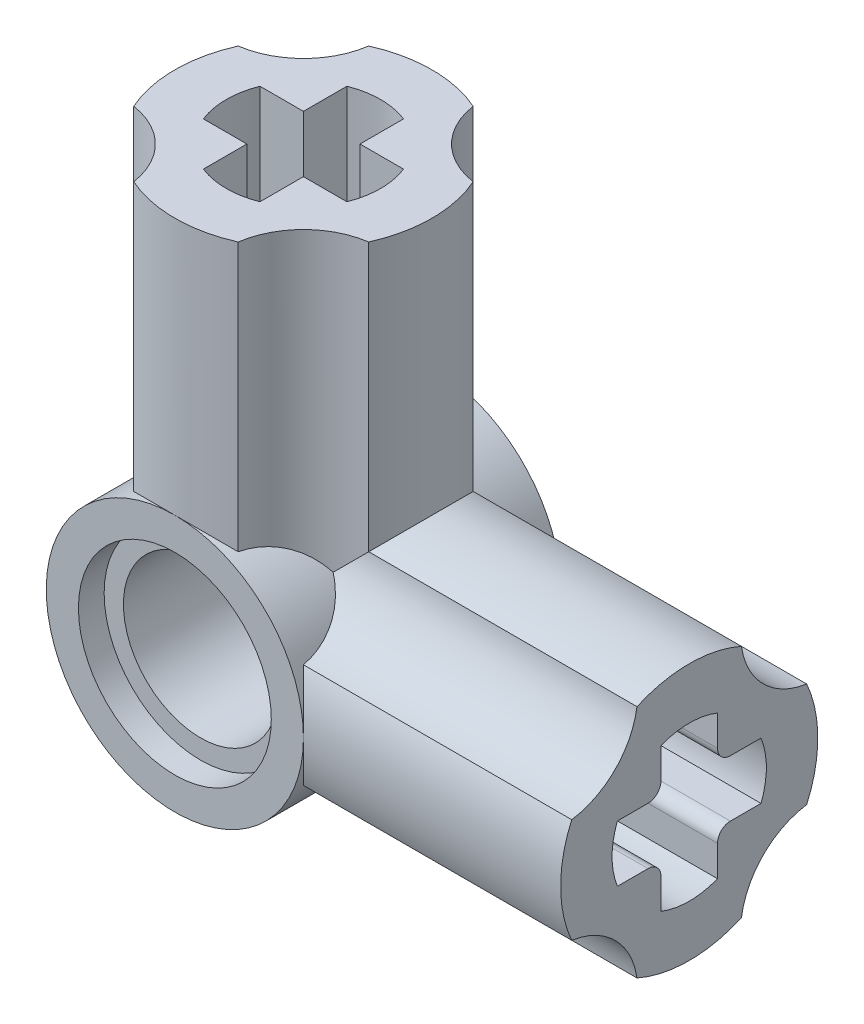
from build123d import *

# Parameters (mm, degrees)
BOSS_EXTRUDE1_DEPTH      = 4
BOSS_EXTRUDE1_DEPTH_BACK = 4
SKETCH1_R                = 4
SKETCH1_R_2              = 2.4
SKETCH2_R                = 3
CUT_EXTRUDE1_DEPTH       = 0.8
BOSS_EXTRUDE2_REACH      = 18.971
BOSS_EXTRUDE2_END_RADIUS = 4
FILLET1_R                = 0.4


with BuildPart() as part:
    # Sketch1 → Boss-Extrude1 (new, two sides: drawn at the far end of the back side and taken through both)
    with BuildSketch(Plane.XY.offset(-BOSS_EXTRUDE1_DEPTH_BACK)):
        with Locations((-12, 0)):
            Circle(SKETCH1_R)
        with Locations((-12, 0)):
            Circle(SKETCH1_R_2, mode=Mode.SUBTRACT)
    extrude(amount=BOSS_EXTRUDE1_DEPTH + BOSS_EXTRUDE1_DEPTH_BACK)

    # Sketch2 → Cut-Extrude1 (cut)
    with BuildSketch(Plane.XY.offset(4)):
        with Locations((-12, 0)):
            Circle(SKETCH2_R)
    cut_extrude1 = extrude(amount=-CUT_EXTRUDE1_DEPTH, mode=Mode.SUBTRACT)

    # Mirror1: Cut-Extrude1 across plane
    add(cut_extrude1.mirror(Plane.XY), mode=Mode.SUBTRACT)

    # Boss-Extrude2: up to this cylinder (the profile starts outside it)
    boss_extrude2_end = Plane(origin=(-12, 0, 0), z_dir=(0, 0, 1)) * Cylinder(BOSS_EXTRUDE2_END_RADIUS, 46.942, mode=Mode.PRIVATE)
    # Sketch3 → Boss-Extrude2 (add, up to the surface)
    with BuildSketch(Plane(origin=(0, 0, 0), x_dir=(0, 0, -1), z_dir=(1, 0, 0)), mode=Mode.PRIVATE) as boss_extrude2_sk1:
        with BuildLine():
            ThreePointArc((-1.624913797, -3.655086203), (0, -4), (1.624913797, -3.655086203))
            ThreePointArc((1.624913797, -3.655086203), (2.302943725, -2.302943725), (3.655086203, -1.624913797))
            ThreePointArc((3.655086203, -1.624913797), (4, 0), (3.655086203, 1.624913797))
            ThreePointArc((3.655086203, 1.624913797), (2.302943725, 2.302943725), (1.624913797, 3.655086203))
            ThreePointArc((1.624913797, 3.655086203), (0, 4), (-1.624913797, 3.655086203))
            ThreePointArc((-1.624913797, 3.655086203), (-2.302943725, 2.302943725), (-3.655086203, 1.624913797))
            ThreePointArc((-3.655086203, 1.624913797), (-4, 0), (-3.655086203, -1.624913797))
            ThreePointArc((-3.655086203, -1.624913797), (-2.302943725, -2.302943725), (-1.624913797, -3.655086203))
        make_face()
        with BuildLine():
            Line((-0.88, 2.232845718), (-0.88, 0.88))
            Line((-0.88, 0.88), (-2.232845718, 0.88))
            ThreePointArc((-2.232845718, 0.88), (-2.4, 0), (-2.232845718, -0.88))
            Line((-2.232845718, -0.88), (-0.88, -0.88))
            Line((-0.88, -0.88), (-0.88, -2.232845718))
            ThreePointArc((-0.88, -2.232845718), (0, -2.4), (0.88, -2.232845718))
            Line((0.88, -2.232845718), (0.88, -0.88))
            Line((0.88, -0.88), (2.232845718, -0.88))
            ThreePointArc((2.232845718, -0.88), (2.4, 0), (2.232845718, 0.88))
            Line((2.232845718, 0.88), (0.88, 0.88))
            Line((0.88, 0.88), (0.88, 2.232845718))
            ThreePointArc((0.88, 2.232845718), (0, 2.4), (-0.88, 2.232845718))
        make_face(mode=Mode.SUBTRACT)
    boss_extrude2_tool1 = extrude(boss_extrude2_sk1.sketch, amount=-BOSS_EXTRUDE2_REACH, mode=Mode.PRIVATE) - boss_extrude2_end
    boss_extrude2 = boss_extrude2_tool1.solids().sort_by_distance((0, -3.886863, 0))[0]
    add(boss_extrude2)

    # Fillet1
    fillet1_edges = [part.edges().sort_by_distance(p)[0] for p in [
        (-4.049000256, 0.88, -0.88),
        (-4.049000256, -0.88, -0.88),
        (-4.049000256, -0.88, 0.88),
        (-4.049000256, 0.88, 0.88),
    ]]
    fillet(fillet1_edges, radius=FILLET1_R)

    # Mirror2: Boss-Extrude2 across plane
    add(boss_extrude2.mirror(Plane(origin=(-6, 6, 0), x_dir=(0, 0, 1), z_dir=(-0.7071067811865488, 0.7071067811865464, 0))))


solid = part.part
